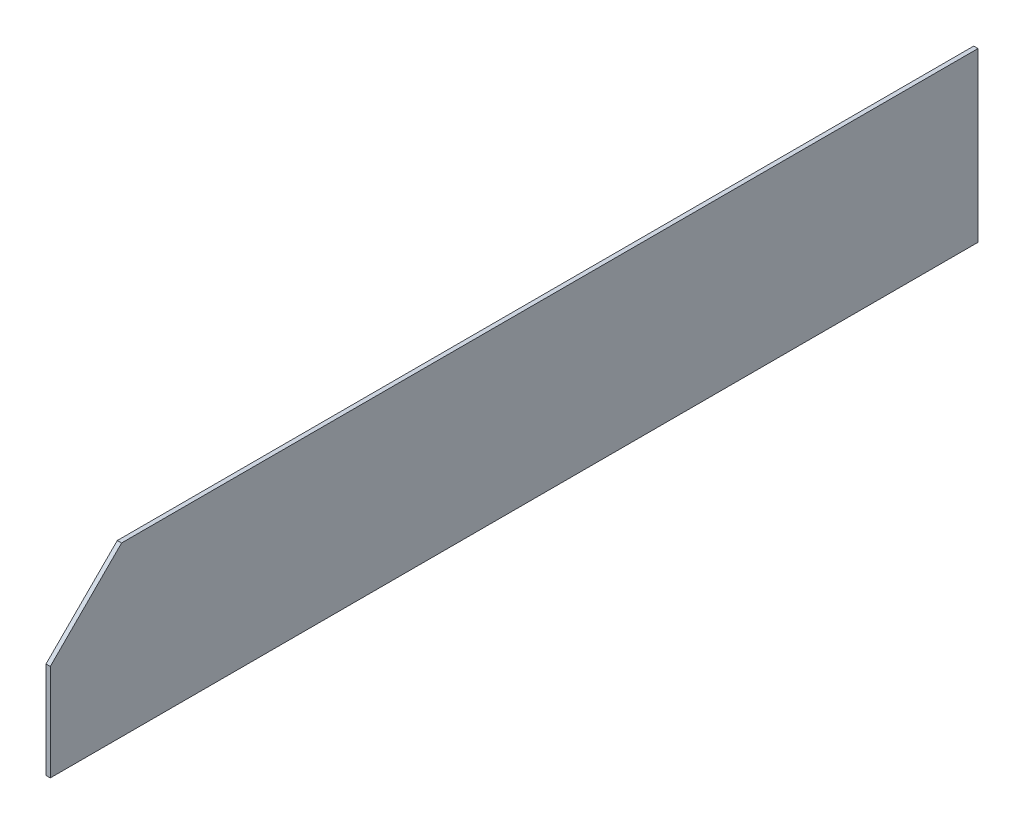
from build123d import *

# Parameters (mm, degrees)
BOSS_EXTRUDE1_DEPTH = 3.175


with BuildPart() as part:
    # Sketch1 → Boss-Extrude1 (new body)
    with BuildSketch(Plane(origin=(-607.540370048, 0, 0), x_dir=(0, 0, -1), z_dir=(1, 0, 0))):
        Polygon((-1391.590752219, 277.550649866), (-1391.590752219, 349.260521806), (-1338.639151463, 402.212122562), (-702.615752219, 402.212122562), (-702.615752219, 277.550649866), align=None)
    extrude(amount=-BOSS_EXTRUDE1_DEPTH)


solid = part.part
